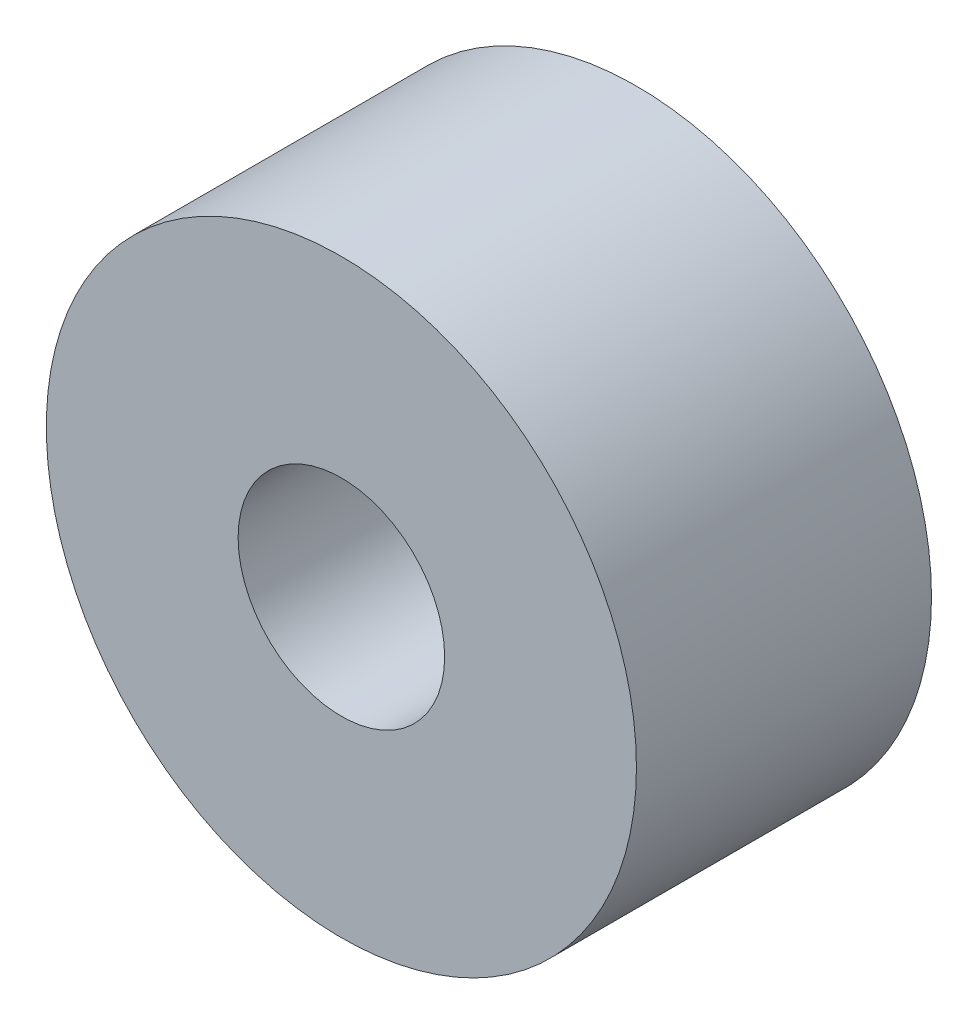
ISO-10303-21;
HEADER;
FILE_DESCRIPTION(('STEP AP214'),'2;1');
FILE_NAME('part.step','',(''),(''),'','','');
FILE_SCHEMA(('AUTOMOTIVE_DESIGN { 1 0 10303 214 1 1 1 1 }'));
ENDSEC;
DATA;
#1=APPLICATION_CONTEXT('core data for automotive mechanical design processes');
#2=APPLICATION_PROTOCOL_DEFINITION('international standard','automotive_design',2000,#1);
#3=PRODUCT_CONTEXT('',#1,'mechanical');
#4=PRODUCT('Part','Part','',(#3));
#5=PRODUCT_RELATED_PRODUCT_CATEGORY('part','',(#4));
#6=PRODUCT_DEFINITION_FORMATION('','',#4);
#7=PRODUCT_DEFINITION_CONTEXT('part definition',#1,'design');
#8=PRODUCT_DEFINITION('design','',#6,#7);
#9=PRODUCT_DEFINITION_SHAPE('','',#8);
#10=(LENGTH_UNIT() NAMED_UNIT(*) SI_UNIT(.MILLI.,.METRE.));
#11=(NAMED_UNIT(*) PLANE_ANGLE_UNIT() SI_UNIT($,.RADIAN.));
#12=(NAMED_UNIT(*) SI_UNIT($,.STERADIAN.) SOLID_ANGLE_UNIT());
#13=UNCERTAINTY_MEASURE_WITH_UNIT(LENGTH_MEASURE(1.E-05),#10,'distance_accuracy_value','');
#14=(GEOMETRIC_REPRESENTATION_CONTEXT(3) GLOBAL_UNCERTAINTY_ASSIGNED_CONTEXT((#13)) GLOBAL_UNIT_ASSIGNED_CONTEXT((#10,
#11,#12)) REPRESENTATION_CONTEXT('',''));
#15=CARTESIAN_POINT('',(0.,0.,0.));
#16=DIRECTION('',(0.,0.,1.));
#17=DIRECTION('',(1.,0.,0.));
#18=AXIS2_PLACEMENT_3D('',#15,#16,#17);
#19=CARTESIAN_POINT('',(0.,0.,20.));
#20=DIRECTION('',(0.,0.,1.));
#21=DIRECTION('',(1.,0.,0.));
#22=AXIS2_PLACEMENT_3D('',#19,#20,#21);
#23=PLANE('',#22);
#24=CARTESIAN_POINT('',(0.,0.,20.));
#25=DIRECTION('',(0.,0.,1.));
#26=DIRECTION('',(1.,0.,0.));
#27=AXIS2_PLACEMENT_3D('',#24,#25,#26);
#28=CIRCLE('',#27,20.);
#29=CARTESIAN_POINT('',(20.,0.,20.));
#30=VERTEX_POINT('',#29);
#31=EDGE_CURVE('E10',#30,#30,#28,.T.);
#32=ORIENTED_EDGE('',*,*,#31,.T.);
#33=EDGE_LOOP('',(#32));
#34=FACE_BOUND('',#33,.T.);
#35=CARTESIAN_POINT('',(0.,0.,20.));
#36=DIRECTION('',(0.,0.,1.));
#37=DIRECTION('',(1.,0.,0.));
#38=AXIS2_PLACEMENT_3D('',#35,#36,#37);
#39=CIRCLE('',#38,7.);
#40=CARTESIAN_POINT('',(7.,0.,20.));
#41=VERTEX_POINT('',#40);
#42=EDGE_CURVE('E39',#41,#41,#39,.T.);
#43=ORIENTED_EDGE('',*,*,#42,.F.);
#44=EDGE_LOOP('',(#43));
#45=FACE_BOUND('',#44,.T.);
#46=ADVANCED_FACE('F28',(#34,#45),#23,.T.);
#47=CARTESIAN_POINT('',(0.,0.,0.));
#48=DIRECTION('',(0.,0.,1.));
#49=DIRECTION('',(1.,0.,0.));
#50=AXIS2_PLACEMENT_3D('',#47,#48,#49);
#51=PLANE('',#50);
#52=CARTESIAN_POINT('',(0.,0.,0.));
#53=DIRECTION('',(0.,0.,1.));
#54=DIRECTION('',(1.,0.,0.));
#55=AXIS2_PLACEMENT_3D('',#52,#53,#54);
#56=CIRCLE('',#55,20.);
#57=CARTESIAN_POINT('',(20.,0.,0.));
#58=VERTEX_POINT('',#57);
#59=EDGE_CURVE('E35',#58,#58,#56,.T.);
#60=ORIENTED_EDGE('',*,*,#59,.F.);
#61=EDGE_LOOP('',(#60));
#62=FACE_BOUND('',#61,.T.);
#63=CARTESIAN_POINT('',(0.,0.,0.));
#64=DIRECTION('',(0.,0.,1.));
#65=DIRECTION('',(1.,0.,0.));
#66=AXIS2_PLACEMENT_3D('',#63,#64,#65);
#67=CIRCLE('',#66,7.);
#68=CARTESIAN_POINT('',(7.,0.,0.));
#69=VERTEX_POINT('',#68);
#70=EDGE_CURVE('E43',#69,#69,#67,.T.);
#71=ORIENTED_EDGE('',*,*,#70,.T.);
#72=EDGE_LOOP('',(#71));
#73=FACE_BOUND('',#72,.T.);
#74=ADVANCED_FACE('F49',(#62,#73),#51,.F.);
#75=CARTESIAN_POINT('',(0.,0.,20.));
#76=DIRECTION('',(0.,0.,-1.));
#77=DIRECTION('',(-1.,0.,0.));
#78=AXIS2_PLACEMENT_3D('',#75,#76,#77);
#79=CYLINDRICAL_SURFACE('',#78,20.);
#80=ORIENTED_EDGE('',*,*,#31,.F.);
#81=EDGE_LOOP('',(#80));
#82=FACE_BOUND('',#81,.T.);
#83=ORIENTED_EDGE('',*,*,#59,.T.);
#84=EDGE_LOOP('',(#83));
#85=FACE_BOUND('',#84,.T.);
#86=ADVANCED_FACE('F30',(#82,#85),#79,.T.);
#87=CARTESIAN_POINT('',(0.,0.,20.));
#88=DIRECTION('',(0.,0.,-1.));
#89=DIRECTION('',(-1.,0.,0.));
#90=AXIS2_PLACEMENT_3D('',#87,#88,#89);
#91=CYLINDRICAL_SURFACE('',#90,7.);
#92=ORIENTED_EDGE('',*,*,#42,.T.);
#93=EDGE_LOOP('',(#92));
#94=FACE_BOUND('',#93,.T.);
#95=ORIENTED_EDGE('',*,*,#70,.F.);
#96=EDGE_LOOP('',(#95));
#97=FACE_BOUND('',#96,.T.);
#98=ADVANCED_FACE('F51',(#94,#97),#91,.F.);
#99=CLOSED_SHELL('',(#46,#74,#86,#98));
#100=MANIFOLD_SOLID_BREP('B2',#99);
#101=ADVANCED_BREP_SHAPE_REPRESENTATION('',(#18,#100),#14);
#102=SHAPE_DEFINITION_REPRESENTATION(#9,#101);
ENDSEC;
END-ISO-10303-21;
